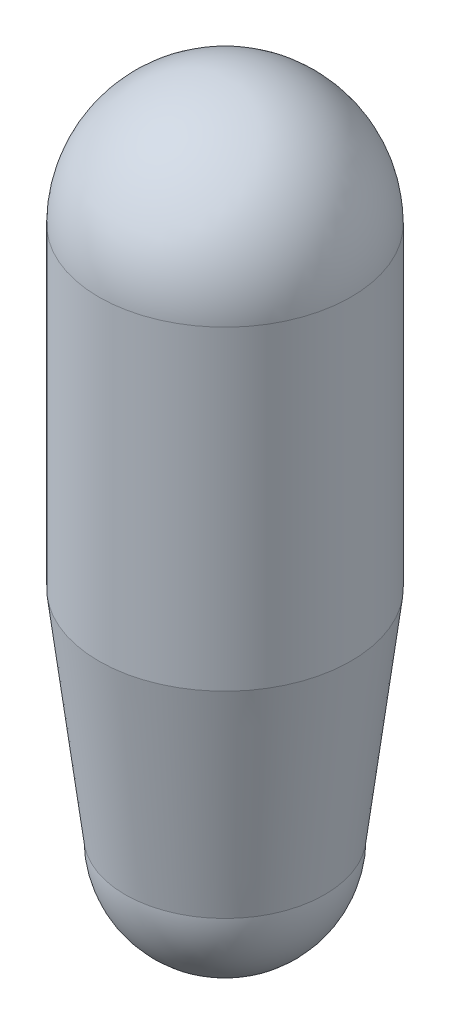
from build123d import *


with BuildPart() as part:
    # Sketch1 → Revolve1 (revolve)
    with BuildSketch(Plane.XY):
        with BuildLine():
            Line((-60.96, 0), (60.96, 0))
            ThreePointArc((60.96, 0), (0, 60.96), (-60.96, 0))
        make_face()
    revolve(axis=Axis((-60.96, 0, 0), (1, 0, 0)))


with BuildPart() as body_2:
    # Sketch2 → Revolve2 (revolve)
    with BuildSketch(Plane.XY):
        with BuildLine():
            Line((-48.26, -256.54), (48.26, -256.54))
            ThreePointArc((48.26, -256.54), (0, -304.8), (-48.26, -256.54))
        make_face()
    revolve(axis=Axis((-48.26, -256.54, 0), (1, 0, 0)))


with BuildPart() as part_1:
    add(part.part)

    add(body_2.part)  # Revolve3 merges body 2
    # Sketch3 → Revolve3 (revolve)
    with BuildSketch(Plane(origin=(0, 0, 0), x_dir=(0, 0, -1), z_dir=(1, 0, 0)), mode=Mode.PRIVATE) as revolve3_sk:
        Polygon((0, 0), (0, -256.54), (48.26, -256.54), (60.96, -152.4), (60.96, 0), align=None)
    revolve(revolve3_sk.sketch.rotate(Axis((0, 0, 0), (0, -1, 0)), 180), axis=Axis((0, 0, 0), (0, -1, 0)))


solid = part_1.part
